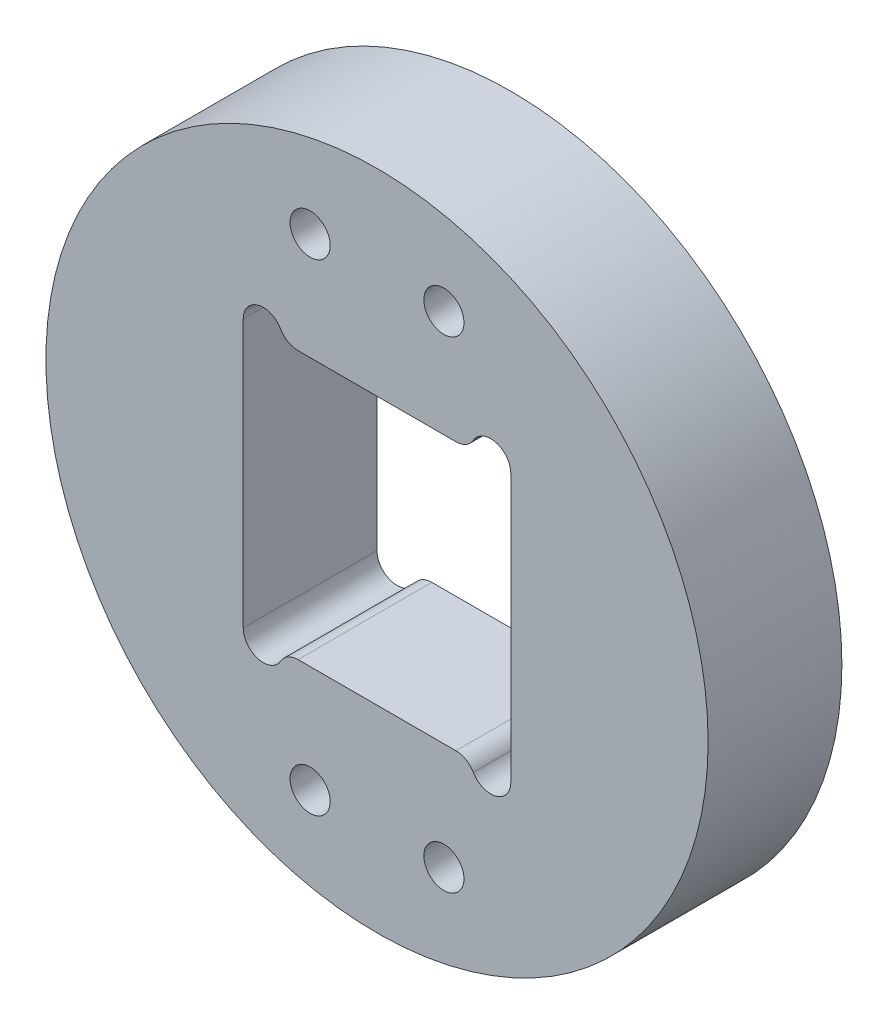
ISO-10303-21;
HEADER;
FILE_DESCRIPTION(('STEP AP214'),'2;1');
FILE_NAME('part.step','',(''),(''),'','','');
FILE_SCHEMA(('AUTOMOTIVE_DESIGN { 1 0 10303 214 1 1 1 1 }'));
ENDSEC;
DATA;
#1=APPLICATION_CONTEXT('core data for automotive mechanical design processes');
#2=APPLICATION_PROTOCOL_DEFINITION('international standard','automotive_design',2000,#1);
#3=PRODUCT_CONTEXT('',#1,'mechanical');
#4=PRODUCT('Part','Part','',(#3));
#5=PRODUCT_RELATED_PRODUCT_CATEGORY('part','',(#4));
#6=PRODUCT_DEFINITION_FORMATION('','',#4);
#7=PRODUCT_DEFINITION_CONTEXT('part definition',#1,'design');
#8=PRODUCT_DEFINITION('design','',#6,#7);
#9=PRODUCT_DEFINITION_SHAPE('','',#8);
#10=(LENGTH_UNIT() NAMED_UNIT(*) SI_UNIT(.MILLI.,.METRE.));
#11=(NAMED_UNIT(*) PLANE_ANGLE_UNIT() SI_UNIT($,.RADIAN.));
#12=(NAMED_UNIT(*) SI_UNIT($,.STERADIAN.) SOLID_ANGLE_UNIT());
#13=UNCERTAINTY_MEASURE_WITH_UNIT(LENGTH_MEASURE(1.E-05),#10,'distance_accuracy_value','');
#14=(GEOMETRIC_REPRESENTATION_CONTEXT(3) GLOBAL_UNCERTAINTY_ASSIGNED_CONTEXT((#13)) GLOBAL_UNIT_ASSIGNED_CONTEXT((#10,
#11,#12)) REPRESENTATION_CONTEXT('',''));
#15=CARTESIAN_POINT('',(0.,0.,0.));
#16=DIRECTION('',(0.,0.,1.));
#17=DIRECTION('',(1.,0.,0.));
#18=AXIS2_PLACEMENT_3D('',#15,#16,#17);
#19=CARTESIAN_POINT('',(0.,0.,10.));
#20=DIRECTION('',(0.,0.,1.));
#21=DIRECTION('',(1.,0.,0.));
#22=AXIS2_PLACEMENT_3D('',#19,#20,#21);
#23=PLANE('',#22);
#24=CARTESIAN_POINT('',(-5.,18.,10.));
#25=DIRECTION('',(0.,0.,1.));
#26=DIRECTION('',(1.,0.,0.));
#27=AXIS2_PLACEMENT_3D('',#24,#25,#26);
#28=CIRCLE('',#27,1.5);
#29=CARTESIAN_POINT('',(-3.5,18.,10.));
#30=VERTEX_POINT('',#29);
#31=EDGE_CURVE('E419',#30,#30,#28,.T.);
#32=ORIENTED_EDGE('',*,*,#31,.F.);
#33=EDGE_LOOP('',(#32));
#34=FACE_BOUND('',#33,.T.);
#35=CARTESIAN_POINT('',(5.,18.,10.));
#36=DIRECTION('',(0.,0.,1.));
#37=DIRECTION('',(1.,0.,0.));
#38=AXIS2_PLACEMENT_3D('',#35,#36,#37);
#39=CIRCLE('',#38,1.5);
#40=CARTESIAN_POINT('',(6.5,18.,10.));
#41=VERTEX_POINT('',#40);
#42=EDGE_CURVE('E197',#41,#41,#39,.T.);
#43=ORIENTED_EDGE('',*,*,#42,.F.);
#44=EDGE_LOOP('',(#43));
#45=FACE_BOUND('',#44,.T.);
#46=CARTESIAN_POINT('',(0.,0.,10.));
#47=DIRECTION('',(0.,0.,1.));
#48=DIRECTION('',(1.,0.,0.));
#49=AXIS2_PLACEMENT_3D('',#46,#47,#48);
#50=CIRCLE('',#49,24.75);
#51=CARTESIAN_POINT('',(24.75,0.,10.));
#52=VERTEX_POINT('',#51);
#53=EDGE_CURVE('E269',#52,#52,#50,.T.);
#54=ORIENTED_EDGE('',*,*,#53,.T.);
#55=EDGE_LOOP('',(#54));
#56=FACE_BOUND('',#55,.T.);
#57=DIRECTION('',(0.,-1.,0.));
#58=VECTOR('',#57,1.);
#59=CARTESIAN_POINT('',(-10.,-10.0000000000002,10.));
#60=LINE('',#59,#58);
#61=CARTESIAN_POINT('',(-10.,10.,10.));
#62=VERTEX_POINT('',#61);
#63=CARTESIAN_POINT('',(-10.,-10.0000000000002,10.));
#64=VERTEX_POINT('',#63);
#65=EDGE_CURVE('E146',#62,#64,#60,.T.);
#66=ORIENTED_EDGE('',*,*,#65,.F.);
#67=CARTESIAN_POINT('',(-8.5,10.,10.));
#68=DIRECTION('',(0.,0.,1.));
#69=DIRECTION('',(1.,0.,0.));
#70=AXIS2_PLACEMENT_3D('',#67,#68,#69);
#71=CIRCLE('',#70,1.5);
#72=CARTESIAN_POINT('',(-7.20096189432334,10.75,10.));
#73=VERTEX_POINT('',#72);
#74=EDGE_CURVE('E137',#73,#62,#71,.T.);
#75=ORIENTED_EDGE('',*,*,#74,.F.);
#76=CARTESIAN_POINT('',(-5.90192378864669,11.5,10.));
#77=DIRECTION('',(0.,0.,-1.));
#78=DIRECTION('',(1.,0.,0.));
#79=AXIS2_PLACEMENT_3D('',#76,#77,#78);
#80=CIRCLE('',#79,1.5);
#81=CARTESIAN_POINT('',(-5.90192378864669,10.,10.));
#82=VERTEX_POINT('',#81);
#83=EDGE_CURVE('E192',#82,#73,#80,.T.);
#84=ORIENTED_EDGE('',*,*,#83,.F.);
#85=DIRECTION('',(-1.,0.,0.));
#86=VECTOR('',#85,1.);
#87=CARTESIAN_POINT('',(-5.90192378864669,10.,10.));
#88=LINE('',#87,#86);
#89=CARTESIAN_POINT('',(5.90192378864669,10.,10.));
#90=VERTEX_POINT('',#89);
#91=EDGE_CURVE('E189',#90,#82,#88,.T.);
#92=ORIENTED_EDGE('',*,*,#91,.F.);
#93=CARTESIAN_POINT('',(5.90192378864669,11.5,10.));
#94=DIRECTION('',(0.,0.,-1.));
#95=DIRECTION('',(1.,0.,0.));
#96=AXIS2_PLACEMENT_3D('',#93,#94,#95);
#97=CIRCLE('',#96,1.5);
#98=CARTESIAN_POINT('',(7.20096189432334,10.75,10.));
#99=VERTEX_POINT('',#98);
#100=EDGE_CURVE('E186',#99,#90,#97,.T.);
#101=ORIENTED_EDGE('',*,*,#100,.F.);
#102=CARTESIAN_POINT('',(8.5,10.,10.));
#103=DIRECTION('',(0.,0.,1.));
#104=DIRECTION('',(1.,0.,0.));
#105=AXIS2_PLACEMENT_3D('',#102,#103,#104);
#106=CIRCLE('',#105,1.5);
#107=CARTESIAN_POINT('',(10.,10.,10.));
#108=VERTEX_POINT('',#107);
#109=EDGE_CURVE('E183',#108,#99,#106,.T.);
#110=ORIENTED_EDGE('',*,*,#109,.F.);
#111=DIRECTION('',(0.,1.,0.));
#112=VECTOR('',#111,1.);
#113=CARTESIAN_POINT('',(10.,10.,10.));
#114=LINE('',#113,#112);
#115=CARTESIAN_POINT('',(10.,-10.0000000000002,10.));
#116=VERTEX_POINT('',#115);
#117=EDGE_CURVE('E180',#116,#108,#114,.T.);
#118=ORIENTED_EDGE('',*,*,#117,.F.);
#119=CARTESIAN_POINT('',(8.5,-10.0000000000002,10.));
#120=DIRECTION('',(0.,0.,1.));
#121=DIRECTION('',(1.,0.,0.));
#122=AXIS2_PLACEMENT_3D('',#119,#120,#121);
#123=CIRCLE('',#122,1.5);
#124=CARTESIAN_POINT('',(7.20096189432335,-10.7500000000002,10.));
#125=VERTEX_POINT('',#124);
#126=EDGE_CURVE('E177',#125,#116,#123,.T.);
#127=ORIENTED_EDGE('',*,*,#126,.F.);
#128=CARTESIAN_POINT('',(5.90192378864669,-11.5000000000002,10.));
#129=DIRECTION('',(0.,0.,-1.));
#130=DIRECTION('',(1.,0.,0.));
#131=AXIS2_PLACEMENT_3D('',#128,#129,#130);
#132=CIRCLE('',#131,1.5);
#133=CARTESIAN_POINT('',(5.90192378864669,-10.0000000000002,10.));
#134=VERTEX_POINT('',#133);
#135=EDGE_CURVE('E174',#134,#125,#132,.T.);
#136=ORIENTED_EDGE('',*,*,#135,.F.);
#137=DIRECTION('',(1.,0.,0.));
#138=VECTOR('',#137,1.);
#139=CARTESIAN_POINT('',(5.90192378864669,-10.0000000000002,10.));
#140=LINE('',#139,#138);
#141=CARTESIAN_POINT('',(-5.90192378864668,-10.0000000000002,10.));
#142=VERTEX_POINT('',#141);
#143=EDGE_CURVE('E171',#142,#134,#140,.T.);
#144=ORIENTED_EDGE('',*,*,#143,.F.);
#145=CARTESIAN_POINT('',(-5.90192378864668,-11.5000000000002,10.));
#146=DIRECTION('',(0.,0.,-1.));
#147=DIRECTION('',(1.,0.,0.));
#148=AXIS2_PLACEMENT_3D('',#145,#146,#147);
#149=CIRCLE('',#148,1.5);
#150=CARTESIAN_POINT('',(-7.20096189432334,-10.7500000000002,10.));
#151=VERTEX_POINT('',#150);
#152=EDGE_CURVE('E165',#151,#142,#149,.T.);
#153=ORIENTED_EDGE('',*,*,#152,.F.);
#154=CARTESIAN_POINT('',(-8.5,-10.0000000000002,10.));
#155=DIRECTION('',(0.,0.,1.));
#156=DIRECTION('',(1.,0.,0.));
#157=AXIS2_PLACEMENT_3D('',#154,#155,#156);
#158=CIRCLE('',#157,1.5);
#159=EDGE_CURVE('E161',#64,#151,#158,.T.);
#160=ORIENTED_EDGE('',*,*,#159,.F.);
#161=EDGE_LOOP('',(#66,#75,#84,#92,#101,#110,#118,#127,#136,#144,#153,#160));
#162=FACE_BOUND('',#161,.T.);
#163=CARTESIAN_POINT('',(5.,-18.,10.));
#164=DIRECTION('',(0.,0.,1.));
#165=DIRECTION('',(-1.,0.,0.));
#166=AXIS2_PLACEMENT_3D('',#163,#164,#165);
#167=CIRCLE('',#166,1.5);
#168=CARTESIAN_POINT('',(3.49999999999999,-18.,10.));
#169=VERTEX_POINT('',#168);
#170=EDGE_CURVE('E417',#169,#169,#167,.T.);
#171=ORIENTED_EDGE('',*,*,#170,.F.);
#172=EDGE_LOOP('',(#171));
#173=FACE_BOUND('',#172,.T.);
#174=CARTESIAN_POINT('',(-5.,-18.,10.));
#175=DIRECTION('',(0.,0.,1.));
#176=DIRECTION('',(-1.,0.,0.));
#177=AXIS2_PLACEMENT_3D('',#174,#175,#176);
#178=CIRCLE('',#177,1.5);
#179=CARTESIAN_POINT('',(-6.50000000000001,-18.,10.));
#180=VERTEX_POINT('',#179);
#181=EDGE_CURVE('E425',#180,#180,#178,.T.);
#182=ORIENTED_EDGE('',*,*,#181,.F.);
#183=EDGE_LOOP('',(#182));
#184=FACE_BOUND('',#183,.T.);
#185=ADVANCED_FACE('F46',(#34,#45,#56,#162,#173,#184),#23,.T.);
#186=CARTESIAN_POINT('',(0.,0.,0.));
#187=DIRECTION('',(0.,0.,1.));
#188=DIRECTION('',(1.,0.,0.));
#189=AXIS2_PLACEMENT_3D('',#186,#187,#188);
#190=PLANE('',#189);
#191=CARTESIAN_POINT('',(-5.,-18.,0.));
#192=DIRECTION('',(0.,0.,1.));
#193=DIRECTION('',(1.,0.,0.));
#194=AXIS2_PLACEMENT_3D('',#191,#192,#193);
#195=CIRCLE('',#194,3.70000000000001);
#196=CARTESIAN_POINT('',(-1.29999999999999,-18.,0.));
#197=VERTEX_POINT('',#196);
#198=EDGE_CURVE('E288',#197,#197,#195,.T.);
#199=ORIENTED_EDGE('',*,*,#198,.T.);
#200=EDGE_LOOP('',(#199));
#201=FACE_BOUND('',#200,.T.);
#202=CARTESIAN_POINT('',(5.,-18.,0.));
#203=DIRECTION('',(0.,0.,1.));
#204=DIRECTION('',(1.,0.,0.));
#205=AXIS2_PLACEMENT_3D('',#202,#203,#204);
#206=CIRCLE('',#205,3.70000000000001);
#207=CARTESIAN_POINT('',(8.70000000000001,-18.,0.));
#208=VERTEX_POINT('',#207);
#209=EDGE_CURVE('E284',#208,#208,#206,.T.);
#210=ORIENTED_EDGE('',*,*,#209,.T.);
#211=EDGE_LOOP('',(#210));
#212=FACE_BOUND('',#211,.T.);
#213=CARTESIAN_POINT('',(-5.,18.,0.));
#214=DIRECTION('',(0.,0.,1.));
#215=DIRECTION('',(1.,0.,0.));
#216=AXIS2_PLACEMENT_3D('',#213,#214,#215);
#217=CIRCLE('',#216,3.70000000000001);
#218=CARTESIAN_POINT('',(-1.29999999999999,18.,0.));
#219=VERTEX_POINT('',#218);
#220=EDGE_CURVE('E280',#219,#219,#217,.T.);
#221=ORIENTED_EDGE('',*,*,#220,.T.);
#222=EDGE_LOOP('',(#221));
#223=FACE_BOUND('',#222,.T.);
#224=CARTESIAN_POINT('',(5.,18.,0.));
#225=DIRECTION('',(0.,0.,1.));
#226=DIRECTION('',(1.,0.,0.));
#227=AXIS2_PLACEMENT_3D('',#224,#225,#226);
#228=CIRCLE('',#227,3.70000000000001);
#229=CARTESIAN_POINT('',(8.70000000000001,18.,0.));
#230=VERTEX_POINT('',#229);
#231=EDGE_CURVE('E273',#230,#230,#228,.T.);
#232=ORIENTED_EDGE('',*,*,#231,.T.);
#233=EDGE_LOOP('',(#232));
#234=FACE_BOUND('',#233,.T.);
#235=CARTESIAN_POINT('',(0.,0.,0.));
#236=DIRECTION('',(0.,0.,1.));
#237=DIRECTION('',(1.,0.,0.));
#238=AXIS2_PLACEMENT_3D('',#235,#236,#237);
#239=CIRCLE('',#238,24.75);
#240=CARTESIAN_POINT('',(24.75,0.,0.));
#241=VERTEX_POINT('',#240);
#242=EDGE_CURVE('E155',#241,#241,#239,.T.);
#243=ORIENTED_EDGE('',*,*,#242,.F.);
#244=EDGE_LOOP('',(#243));
#245=FACE_BOUND('',#244,.T.);
#246=CARTESIAN_POINT('',(-8.5,10.,0.));
#247=DIRECTION('',(0.,0.,1.));
#248=DIRECTION('',(1.,0.,0.));
#249=AXIS2_PLACEMENT_3D('',#246,#247,#248);
#250=CIRCLE('',#249,1.5);
#251=CARTESIAN_POINT('',(-7.20096189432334,10.75,0.));
#252=VERTEX_POINT('',#251);
#253=CARTESIAN_POINT('',(-10.,10.,0.));
#254=VERTEX_POINT('',#253);
#255=EDGE_CURVE('E71',#252,#254,#250,.T.);
#256=ORIENTED_EDGE('',*,*,#255,.T.);
#257=DIRECTION('',(0.,-1.,0.));
#258=VECTOR('',#257,1.);
#259=CARTESIAN_POINT('',(-10.,-10.0000000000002,0.));
#260=LINE('',#259,#258);
#261=CARTESIAN_POINT('',(-10.,-10.0000000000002,0.));
#262=VERTEX_POINT('',#261);
#263=EDGE_CURVE('E153',#254,#262,#260,.T.);
#264=ORIENTED_EDGE('',*,*,#263,.T.);
#265=CARTESIAN_POINT('',(-8.5,-10.0000000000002,0.));
#266=DIRECTION('',(0.,0.,1.));
#267=DIRECTION('',(1.,0.,0.));
#268=AXIS2_PLACEMENT_3D('',#265,#266,#267);
#269=CIRCLE('',#268,1.5);
#270=CARTESIAN_POINT('',(-7.20096189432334,-10.7500000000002,0.));
#271=VERTEX_POINT('',#270);
#272=EDGE_CURVE('E200',#262,#271,#269,.T.);
#273=ORIENTED_EDGE('',*,*,#272,.T.);
#274=CARTESIAN_POINT('',(-5.90192378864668,-11.5000000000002,0.));
#275=DIRECTION('',(0.,0.,-1.));
#276=DIRECTION('',(1.,0.,0.));
#277=AXIS2_PLACEMENT_3D('',#274,#275,#276);
#278=CIRCLE('',#277,1.5);
#279=CARTESIAN_POINT('',(-5.90192378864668,-10.0000000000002,0.));
#280=VERTEX_POINT('',#279);
#281=EDGE_CURVE('E204',#271,#280,#278,.T.);
#282=ORIENTED_EDGE('',*,*,#281,.T.);
#283=DIRECTION('',(1.,0.,0.));
#284=VECTOR('',#283,1.);
#285=CARTESIAN_POINT('',(5.90192378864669,-10.0000000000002,0.));
#286=LINE('',#285,#284);
#287=CARTESIAN_POINT('',(5.90192378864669,-10.0000000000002,0.));
#288=VERTEX_POINT('',#287);
#289=EDGE_CURVE('E208',#280,#288,#286,.T.);
#290=ORIENTED_EDGE('',*,*,#289,.T.);
#291=CARTESIAN_POINT('',(5.90192378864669,-11.5000000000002,0.));
#292=DIRECTION('',(0.,0.,-1.));
#293=DIRECTION('',(1.,0.,0.));
#294=AXIS2_PLACEMENT_3D('',#291,#292,#293);
#295=CIRCLE('',#294,1.5);
#296=CARTESIAN_POINT('',(7.20096189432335,-10.7500000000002,0.));
#297=VERTEX_POINT('',#296);
#298=EDGE_CURVE('E212',#288,#297,#295,.T.);
#299=ORIENTED_EDGE('',*,*,#298,.T.);
#300=CARTESIAN_POINT('',(8.5,-10.0000000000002,0.));
#301=DIRECTION('',(0.,0.,1.));
#302=DIRECTION('',(1.,0.,0.));
#303=AXIS2_PLACEMENT_3D('',#300,#301,#302);
#304=CIRCLE('',#303,1.5);
#305=CARTESIAN_POINT('',(10.,-10.0000000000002,0.));
#306=VERTEX_POINT('',#305);
#307=EDGE_CURVE('E216',#297,#306,#304,.T.);
#308=ORIENTED_EDGE('',*,*,#307,.T.);
#309=DIRECTION('',(0.,1.,0.));
#310=VECTOR('',#309,1.);
#311=CARTESIAN_POINT('',(10.,10.,0.));
#312=LINE('',#311,#310);
#313=CARTESIAN_POINT('',(10.,10.,0.));
#314=VERTEX_POINT('',#313);
#315=EDGE_CURVE('E220',#306,#314,#312,.T.);
#316=ORIENTED_EDGE('',*,*,#315,.T.);
#317=CARTESIAN_POINT('',(8.5,10.,0.));
#318=DIRECTION('',(0.,0.,1.));
#319=DIRECTION('',(1.,0.,0.));
#320=AXIS2_PLACEMENT_3D('',#317,#318,#319);
#321=CIRCLE('',#320,1.5);
#322=CARTESIAN_POINT('',(7.20096189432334,10.75,0.));
#323=VERTEX_POINT('',#322);
#324=EDGE_CURVE('E224',#314,#323,#321,.T.);
#325=ORIENTED_EDGE('',*,*,#324,.T.);
#326=CARTESIAN_POINT('',(5.90192378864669,11.5,0.));
#327=DIRECTION('',(0.,0.,-1.));
#328=DIRECTION('',(1.,0.,0.));
#329=AXIS2_PLACEMENT_3D('',#326,#327,#328);
#330=CIRCLE('',#329,1.5);
#331=CARTESIAN_POINT('',(5.90192378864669,10.,0.));
#332=VERTEX_POINT('',#331);
#333=EDGE_CURVE('E228',#323,#332,#330,.T.);
#334=ORIENTED_EDGE('',*,*,#333,.T.);
#335=DIRECTION('',(-1.,0.,0.));
#336=VECTOR('',#335,1.);
#337=CARTESIAN_POINT('',(-5.90192378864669,10.,0.));
#338=LINE('',#337,#336);
#339=CARTESIAN_POINT('',(-5.90192378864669,10.,0.));
#340=VERTEX_POINT('',#339);
#341=EDGE_CURVE('E232',#332,#340,#338,.T.);
#342=ORIENTED_EDGE('',*,*,#341,.T.);
#343=CARTESIAN_POINT('',(-5.90192378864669,11.5,0.));
#344=DIRECTION('',(0.,0.,-1.));
#345=DIRECTION('',(1.,0.,0.));
#346=AXIS2_PLACEMENT_3D('',#343,#344,#345);
#347=CIRCLE('',#346,1.5);
#348=EDGE_CURVE('E147',#340,#252,#347,.T.);
#349=ORIENTED_EDGE('',*,*,#348,.T.);
#350=EDGE_LOOP('',(#256,#264,#273,#282,#290,#299,#308,#316,#325,#334,#342,#349));
#351=FACE_BOUND('',#350,.T.);
#352=ADVANCED_FACE('F312',(#201,#212,#223,#234,#245,#351),#190,.F.);
#353=CARTESIAN_POINT('',(0.,0.,10.));
#354=DIRECTION('',(0.,0.,-1.));
#355=DIRECTION('',(-1.,0.,0.));
#356=AXIS2_PLACEMENT_3D('',#353,#354,#355);
#357=CYLINDRICAL_SURFACE('',#356,24.75);
#358=ORIENTED_EDGE('',*,*,#53,.F.);
#359=EDGE_LOOP('',(#358));
#360=FACE_BOUND('',#359,.T.);
#361=ORIENTED_EDGE('',*,*,#242,.T.);
#362=EDGE_LOOP('',(#361));
#363=FACE_BOUND('',#362,.T.);
#364=ADVANCED_FACE('F315',(#360,#363),#357,.T.);
#365=CARTESIAN_POINT('',(-8.5,10.,10.));
#366=DIRECTION('',(0.,0.,-1.));
#367=DIRECTION('',(-1.,0.,0.));
#368=AXIS2_PLACEMENT_3D('',#365,#366,#367);
#369=CYLINDRICAL_SURFACE('',#368,1.5);
#370=ORIENTED_EDGE('',*,*,#255,.F.);
#371=DIRECTION('',(0.,0.,-1.));
#372=VECTOR('',#371,1.);
#373=CARTESIAN_POINT('',(-7.20096189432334,10.75,10.));
#374=LINE('',#373,#372);
#375=EDGE_CURVE('E141',#73,#252,#374,.T.);
#376=ORIENTED_EDGE('',*,*,#375,.F.);
#377=ORIENTED_EDGE('',*,*,#74,.T.);
#378=DIRECTION('',(0.,0.,-1.));
#379=VECTOR('',#378,1.);
#380=CARTESIAN_POINT('',(-10.,10.,10.));
#381=LINE('',#380,#379);
#382=EDGE_CURVE('E140',#62,#254,#381,.T.);
#383=ORIENTED_EDGE('',*,*,#382,.T.);
#384=EDGE_LOOP('',(#370,#376,#377,#383));
#385=FACE_BOUND('',#384,.T.);
#386=ADVANCED_FACE('F139',(#385),#369,.F.);
#387=CARTESIAN_POINT('',(-10.,-10.0000000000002,10.));
#388=DIRECTION('',(1.,0.,0.));
#389=DIRECTION('',(0.,1.,0.));
#390=AXIS2_PLACEMENT_3D('',#387,#388,#389);
#391=PLANE('',#390);
#392=ORIENTED_EDGE('',*,*,#263,.F.);
#393=ORIENTED_EDGE('',*,*,#382,.F.);
#394=ORIENTED_EDGE('',*,*,#65,.T.);
#395=DIRECTION('',(0.,0.,-1.));
#396=VECTOR('',#395,1.);
#397=CARTESIAN_POINT('',(-10.,-10.0000000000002,10.));
#398=LINE('',#397,#396);
#399=EDGE_CURVE('E156',#64,#262,#398,.T.);
#400=ORIENTED_EDGE('',*,*,#399,.T.);
#401=EDGE_LOOP('',(#392,#393,#394,#400));
#402=FACE_BOUND('',#401,.T.);
#403=ADVANCED_FACE('F150',(#402),#391,.T.);
#404=CARTESIAN_POINT('',(-8.5,-10.0000000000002,10.));
#405=DIRECTION('',(0.,0.,-1.));
#406=DIRECTION('',(-1.,0.,0.));
#407=AXIS2_PLACEMENT_3D('',#404,#405,#406);
#408=CYLINDRICAL_SURFACE('',#407,1.5);
#409=ORIENTED_EDGE('',*,*,#272,.F.);
#410=ORIENTED_EDGE('',*,*,#399,.F.);
#411=ORIENTED_EDGE('',*,*,#159,.T.);
#412=DIRECTION('',(0.,0.,-1.));
#413=VECTOR('',#412,1.);
#414=CARTESIAN_POINT('',(-7.20096189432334,-10.7500000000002,10.));
#415=LINE('',#414,#413);
#416=EDGE_CURVE('E264',#151,#271,#415,.T.);
#417=ORIENTED_EDGE('',*,*,#416,.T.);
#418=EDGE_LOOP('',(#409,#410,#411,#417));
#419=FACE_BOUND('',#418,.T.);
#420=ADVANCED_FACE('F364',(#419),#408,.F.);
#421=CARTESIAN_POINT('',(-5.90192378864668,-11.5000000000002,10.));
#422=DIRECTION('',(0.,0.,-1.));
#423=DIRECTION('',(-1.,0.,0.));
#424=AXIS2_PLACEMENT_3D('',#421,#422,#423);
#425=CYLINDRICAL_SURFACE('',#424,1.5);
#426=ORIENTED_EDGE('',*,*,#281,.F.);
#427=ORIENTED_EDGE('',*,*,#416,.F.);
#428=ORIENTED_EDGE('',*,*,#152,.T.);
#429=DIRECTION('',(0.,0.,-1.));
#430=VECTOR('',#429,1.);
#431=CARTESIAN_POINT('',(-5.90192378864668,-10.0000000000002,10.));
#432=LINE('',#431,#430);
#433=EDGE_CURVE('E261',#142,#280,#432,.T.);
#434=ORIENTED_EDGE('',*,*,#433,.T.);
#435=EDGE_LOOP('',(#426,#427,#428,#434));
#436=FACE_BOUND('',#435,.T.);
#437=ADVANCED_FACE('F360',(#436),#425,.T.);
#438=CARTESIAN_POINT('',(5.90192378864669,-10.0000000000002,10.));
#439=DIRECTION('',(0.,1.,0.));
#440=DIRECTION('',(-1.,0.,0.));
#441=AXIS2_PLACEMENT_3D('',#438,#439,#440);
#442=PLANE('',#441);
#443=ORIENTED_EDGE('',*,*,#289,.F.);
#444=ORIENTED_EDGE('',*,*,#433,.F.);
#445=ORIENTED_EDGE('',*,*,#143,.T.);
#446=DIRECTION('',(0.,0.,-1.));
#447=VECTOR('',#446,1.);
#448=CARTESIAN_POINT('',(5.90192378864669,-10.0000000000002,10.));
#449=LINE('',#448,#447);
#450=EDGE_CURVE('E258',#134,#288,#449,.T.);
#451=ORIENTED_EDGE('',*,*,#450,.T.);
#452=EDGE_LOOP('',(#443,#444,#445,#451));
#453=FACE_BOUND('',#452,.T.);
#454=ADVANCED_FACE('F357',(#453),#442,.T.);
#455=CARTESIAN_POINT('',(5.90192378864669,-11.5000000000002,10.));
#456=DIRECTION('',(0.,0.,-1.));
#457=DIRECTION('',(-1.,0.,0.));
#458=AXIS2_PLACEMENT_3D('',#455,#456,#457);
#459=CYLINDRICAL_SURFACE('',#458,1.5);
#460=ORIENTED_EDGE('',*,*,#298,.F.);
#461=ORIENTED_EDGE('',*,*,#450,.F.);
#462=ORIENTED_EDGE('',*,*,#135,.T.);
#463=DIRECTION('',(0.,0.,-1.));
#464=VECTOR('',#463,1.);
#465=CARTESIAN_POINT('',(7.20096189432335,-10.7500000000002,10.));
#466=LINE('',#465,#464);
#467=EDGE_CURVE('E255',#125,#297,#466,.T.);
#468=ORIENTED_EDGE('',*,*,#467,.T.);
#469=EDGE_LOOP('',(#460,#461,#462,#468));
#470=FACE_BOUND('',#469,.T.);
#471=ADVANCED_FACE('F351',(#470),#459,.T.);
#472=CARTESIAN_POINT('',(8.5,-10.0000000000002,10.));
#473=DIRECTION('',(0.,0.,-1.));
#474=DIRECTION('',(-1.,0.,0.));
#475=AXIS2_PLACEMENT_3D('',#472,#473,#474);
#476=CYLINDRICAL_SURFACE('',#475,1.5);
#477=ORIENTED_EDGE('',*,*,#307,.F.);
#478=ORIENTED_EDGE('',*,*,#467,.F.);
#479=ORIENTED_EDGE('',*,*,#126,.T.);
#480=DIRECTION('',(0.,0.,-1.));
#481=VECTOR('',#480,1.);
#482=CARTESIAN_POINT('',(10.,-10.0000000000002,10.));
#483=LINE('',#482,#481);
#484=EDGE_CURVE('E252',#116,#306,#483,.T.);
#485=ORIENTED_EDGE('',*,*,#484,.T.);
#486=EDGE_LOOP('',(#477,#478,#479,#485));
#487=FACE_BOUND('',#486,.T.);
#488=ADVANCED_FACE('F347',(#487),#476,.F.);
#489=CARTESIAN_POINT('',(10.,10.,10.));
#490=DIRECTION('',(-1.,0.,0.));
#491=DIRECTION('',(0.,-1.,0.));
#492=AXIS2_PLACEMENT_3D('',#489,#490,#491);
#493=PLANE('',#492);
#494=ORIENTED_EDGE('',*,*,#315,.F.);
#495=ORIENTED_EDGE('',*,*,#484,.F.);
#496=ORIENTED_EDGE('',*,*,#117,.T.);
#497=DIRECTION('',(0.,0.,-1.));
#498=VECTOR('',#497,1.);
#499=CARTESIAN_POINT('',(10.,10.,10.));
#500=LINE('',#499,#498);
#501=EDGE_CURVE('E249',#108,#314,#500,.T.);
#502=ORIENTED_EDGE('',*,*,#501,.T.);
#503=EDGE_LOOP('',(#494,#495,#496,#502));
#504=FACE_BOUND('',#503,.T.);
#505=ADVANCED_FACE('F344',(#504),#493,.T.);
#506=CARTESIAN_POINT('',(8.5,10.,10.));
#507=DIRECTION('',(0.,0.,-1.));
#508=DIRECTION('',(-1.,0.,0.));
#509=AXIS2_PLACEMENT_3D('',#506,#507,#508);
#510=CYLINDRICAL_SURFACE('',#509,1.5);
#511=ORIENTED_EDGE('',*,*,#324,.F.);
#512=ORIENTED_EDGE('',*,*,#501,.F.);
#513=ORIENTED_EDGE('',*,*,#109,.T.);
#514=DIRECTION('',(0.,0.,-1.));
#515=VECTOR('',#514,1.);
#516=CARTESIAN_POINT('',(7.20096189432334,10.75,10.));
#517=LINE('',#516,#515);
#518=EDGE_CURVE('E246',#99,#323,#517,.T.);
#519=ORIENTED_EDGE('',*,*,#518,.T.);
#520=EDGE_LOOP('',(#511,#512,#513,#519));
#521=FACE_BOUND('',#520,.T.);
#522=ADVANCED_FACE('F336',(#521),#510,.F.);
#523=CARTESIAN_POINT('',(5.90192378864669,11.5,10.));
#524=DIRECTION('',(0.,0.,-1.));
#525=DIRECTION('',(-1.,0.,0.));
#526=AXIS2_PLACEMENT_3D('',#523,#524,#525);
#527=CYLINDRICAL_SURFACE('',#526,1.5);
#528=ORIENTED_EDGE('',*,*,#333,.F.);
#529=ORIENTED_EDGE('',*,*,#518,.F.);
#530=ORIENTED_EDGE('',*,*,#100,.T.);
#531=DIRECTION('',(0.,0.,-1.));
#532=VECTOR('',#531,1.);
#533=CARTESIAN_POINT('',(5.90192378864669,10.,10.));
#534=LINE('',#533,#532);
#535=EDGE_CURVE('E243',#90,#332,#534,.T.);
#536=ORIENTED_EDGE('',*,*,#535,.T.);
#537=EDGE_LOOP('',(#528,#529,#530,#536));
#538=FACE_BOUND('',#537,.T.);
#539=ADVANCED_FACE('F332',(#538),#527,.T.);
#540=CARTESIAN_POINT('',(-5.90192378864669,10.,10.));
#541=DIRECTION('',(0.,-1.,0.));
#542=DIRECTION('',(0.,0.,-1.));
#543=AXIS2_PLACEMENT_3D('',#540,#541,#542);
#544=PLANE('',#543);
#545=ORIENTED_EDGE('',*,*,#341,.F.);
#546=ORIENTED_EDGE('',*,*,#535,.F.);
#547=ORIENTED_EDGE('',*,*,#91,.T.);
#548=DIRECTION('',(0.,0.,-1.));
#549=VECTOR('',#548,1.);
#550=CARTESIAN_POINT('',(-5.90192378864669,10.,10.));
#551=LINE('',#550,#549);
#552=EDGE_CURVE('E63',#82,#340,#551,.T.);
#553=ORIENTED_EDGE('',*,*,#552,.T.);
#554=EDGE_LOOP('',(#545,#546,#547,#553));
#555=FACE_BOUND('',#554,.T.);
#556=ADVANCED_FACE('F329',(#555),#544,.T.);
#557=CARTESIAN_POINT('',(-5.90192378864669,11.5,10.));
#558=DIRECTION('',(0.,0.,-1.));
#559=DIRECTION('',(-1.,0.,0.));
#560=AXIS2_PLACEMENT_3D('',#557,#558,#559);
#561=CYLINDRICAL_SURFACE('',#560,1.5);
#562=ORIENTED_EDGE('',*,*,#348,.F.);
#563=ORIENTED_EDGE('',*,*,#552,.F.);
#564=ORIENTED_EDGE('',*,*,#83,.T.);
#565=ORIENTED_EDGE('',*,*,#375,.T.);
#566=EDGE_LOOP('',(#562,#563,#564,#565));
#567=FACE_BOUND('',#566,.T.);
#568=ADVANCED_FACE('F323',(#567),#561,.T.);
#569=CARTESIAN_POINT('',(5.,18.,10.));
#570=DIRECTION('',(0.,0.,-1.));
#571=DIRECTION('',(-1.,0.,0.));
#572=AXIS2_PLACEMENT_3D('',#569,#570,#571);
#573=CYLINDRICAL_SURFACE('',#572,1.5);
#574=CARTESIAN_POINT('',(5.,18.,2.20000000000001));
#575=DIRECTION('',(0.,0.,1.));
#576=DIRECTION('',(1.,0.,0.));
#577=AXIS2_PLACEMENT_3D('',#574,#575,#576);
#578=CIRCLE('',#577,1.5);
#579=CARTESIAN_POINT('',(6.5,18.,2.20000000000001));
#580=VERTEX_POINT('',#579);
#581=EDGE_CURVE('E11',#580,#580,#578,.F.);
#582=ORIENTED_EDGE('',*,*,#581,.T.);
#583=EDGE_LOOP('',(#582));
#584=FACE_BOUND('',#583,.T.);
#585=ORIENTED_EDGE('',*,*,#42,.T.);
#586=EDGE_LOOP('',(#585));
#587=FACE_BOUND('',#586,.T.);
#588=ADVANCED_FACE('F413',(#584,#587),#573,.F.);
#589=CARTESIAN_POINT('',(5.,-18.,10.));
#590=DIRECTION('',(0.,0.,-1.));
#591=DIRECTION('',(-1.,0.,0.));
#592=AXIS2_PLACEMENT_3D('',#589,#590,#591);
#593=CYLINDRICAL_SURFACE('',#592,1.5);
#594=CARTESIAN_POINT('',(5.,-18.,2.20000000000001));
#595=DIRECTION('',(0.,0.,1.));
#596=DIRECTION('',(1.,0.,0.));
#597=AXIS2_PLACEMENT_3D('',#594,#595,#596);
#598=CIRCLE('',#597,1.5);
#599=CARTESIAN_POINT('',(6.5,-18.,2.20000000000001));
#600=VERTEX_POINT('',#599);
#601=EDGE_CURVE('E296',#600,#600,#598,.F.);
#602=ORIENTED_EDGE('',*,*,#601,.T.);
#603=EDGE_LOOP('',(#602));
#604=FACE_BOUND('',#603,.T.);
#605=ORIENTED_EDGE('',*,*,#170,.T.);
#606=EDGE_LOOP('',(#605));
#607=FACE_BOUND('',#606,.T.);
#608=ADVANCED_FACE('F410',(#604,#607),#593,.F.);
#609=CARTESIAN_POINT('',(-5.,18.,10.));
#610=DIRECTION('',(0.,0.,-1.));
#611=DIRECTION('',(-1.,0.,0.));
#612=AXIS2_PLACEMENT_3D('',#609,#610,#611);
#613=CYLINDRICAL_SURFACE('',#612,1.5);
#614=CARTESIAN_POINT('',(-5.,18.,2.20000000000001));
#615=DIRECTION('',(0.,0.,1.));
#616=DIRECTION('',(1.,0.,0.));
#617=AXIS2_PLACEMENT_3D('',#614,#615,#616);
#618=CIRCLE('',#617,1.5);
#619=CARTESIAN_POINT('',(-3.5,18.,2.20000000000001));
#620=VERTEX_POINT('',#619);
#621=EDGE_CURVE('E56',#620,#620,#618,.F.);
#622=ORIENTED_EDGE('',*,*,#621,.T.);
#623=EDGE_LOOP('',(#622));
#624=FACE_BOUND('',#623,.T.);
#625=ORIENTED_EDGE('',*,*,#31,.T.);
#626=EDGE_LOOP('',(#625));
#627=FACE_BOUND('',#626,.T.);
#628=ADVANCED_FACE('F303',(#624,#627),#613,.F.);
#629=CARTESIAN_POINT('',(-5.,-18.,10.));
#630=DIRECTION('',(0.,0.,-1.));
#631=DIRECTION('',(-1.,0.,0.));
#632=AXIS2_PLACEMENT_3D('',#629,#630,#631);
#633=CYLINDRICAL_SURFACE('',#632,1.5);
#634=CARTESIAN_POINT('',(-5.,-18.,2.20000000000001));
#635=DIRECTION('',(0.,0.,1.));
#636=DIRECTION('',(1.,0.,0.));
#637=AXIS2_PLACEMENT_3D('',#634,#635,#636);
#638=CIRCLE('',#637,1.5);
#639=CARTESIAN_POINT('',(-3.5,-18.,2.20000000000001));
#640=VERTEX_POINT('',#639);
#641=EDGE_CURVE('E292',#640,#640,#638,.F.);
#642=ORIENTED_EDGE('',*,*,#641,.T.);
#643=EDGE_LOOP('',(#642));
#644=FACE_BOUND('',#643,.T.);
#645=ORIENTED_EDGE('',*,*,#181,.T.);
#646=EDGE_LOOP('',(#645));
#647=FACE_BOUND('',#646,.T.);
#648=ADVANCED_FACE('F392',(#644,#647),#633,.F.);
#649=CARTESIAN_POINT('',(-5.,-18.,0.));
#650=DIRECTION('',(0.,0.,-1.));
#651=DIRECTION('',(-1.,0.,0.));
#652=AXIS2_PLACEMENT_3D('',#649,#650,#651);
#653=CONICAL_SURFACE('',#652,3.70000000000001,0.785398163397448);
#654=ORIENTED_EDGE('',*,*,#641,.F.);
#655=EDGE_LOOP('',(#654));
#656=FACE_BOUND('',#655,.T.);
#657=ORIENTED_EDGE('',*,*,#198,.F.);
#658=EDGE_LOOP('',(#657));
#659=FACE_BOUND('',#658,.T.);
#660=ADVANCED_FACE('F386',(#656,#659),#653,.F.);
#661=CARTESIAN_POINT('',(5.,-18.,0.));
#662=DIRECTION('',(0.,0.,-1.));
#663=DIRECTION('',(-1.,0.,0.));
#664=AXIS2_PLACEMENT_3D('',#661,#662,#663);
#665=CONICAL_SURFACE('',#664,3.70000000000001,0.785398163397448);
#666=ORIENTED_EDGE('',*,*,#601,.F.);
#667=EDGE_LOOP('',(#666));
#668=FACE_BOUND('',#667,.T.);
#669=ORIENTED_EDGE('',*,*,#209,.F.);
#670=EDGE_LOOP('',(#669));
#671=FACE_BOUND('',#670,.T.);
#672=ADVANCED_FACE('F309',(#668,#671),#665,.F.);
#673=CARTESIAN_POINT('',(-5.,18.,0.));
#674=DIRECTION('',(0.,0.,-1.));
#675=DIRECTION('',(-1.,0.,0.));
#676=AXIS2_PLACEMENT_3D('',#673,#674,#675);
#677=CONICAL_SURFACE('',#676,3.70000000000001,0.785398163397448);
#678=ORIENTED_EDGE('',*,*,#621,.F.);
#679=EDGE_LOOP('',(#678));
#680=FACE_BOUND('',#679,.T.);
#681=ORIENTED_EDGE('',*,*,#220,.F.);
#682=EDGE_LOOP('',(#681));
#683=FACE_BOUND('',#682,.T.);
#684=ADVANCED_FACE('F306',(#680,#683),#677,.F.);
#685=CARTESIAN_POINT('',(5.,18.,0.));
#686=DIRECTION('',(0.,0.,-1.));
#687=DIRECTION('',(-1.,0.,0.));
#688=AXIS2_PLACEMENT_3D('',#685,#686,#687);
#689=CONICAL_SURFACE('',#688,3.70000000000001,0.785398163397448);
#690=ORIENTED_EDGE('',*,*,#581,.F.);
#691=EDGE_LOOP('',(#690));
#692=FACE_BOUND('',#691,.T.);
#693=ORIENTED_EDGE('',*,*,#231,.F.);
#694=EDGE_LOOP('',(#693));
#695=FACE_BOUND('',#694,.T.);
#696=ADVANCED_FACE('F49',(#692,#695),#689,.F.);
#697=CLOSED_SHELL('',(#185,#352,#364,#386,#403,#420,#437,#454,#471,#488,#505,#522,#539,#556,
#568,#588,#608,#628,#648,#660,#672,#684,#696));
#698=MANIFOLD_SOLID_BREP('B2',#697);
#699=ADVANCED_BREP_SHAPE_REPRESENTATION('',(#18,#698),#14);
#700=SHAPE_DEFINITION_REPRESENTATION(#9,#699);
ENDSEC;
END-ISO-10303-21;
